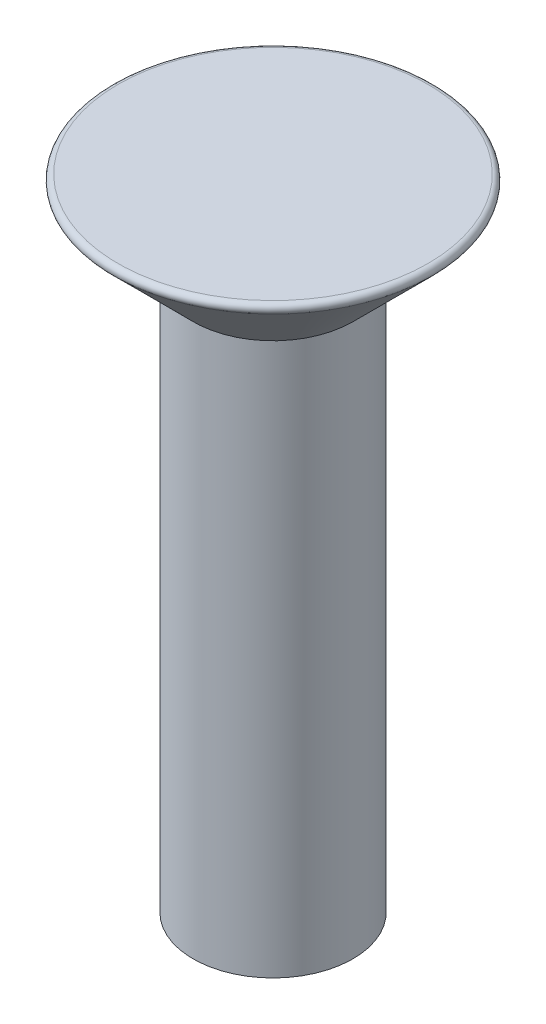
ISO-10303-21;
HEADER;
FILE_DESCRIPTION(('STEP AP214'),'2;1');
FILE_NAME('part.step','',(''),(''),'','','');
FILE_SCHEMA(('AUTOMOTIVE_DESIGN { 1 0 10303 214 1 1 1 1 }'));
ENDSEC;
DATA;
#1=APPLICATION_CONTEXT('core data for automotive mechanical design processes');
#2=APPLICATION_PROTOCOL_DEFINITION('international standard','automotive_design',2000,#1);
#3=PRODUCT_CONTEXT('',#1,'mechanical');
#4=PRODUCT('Part','Part','',(#3));
#5=PRODUCT_RELATED_PRODUCT_CATEGORY('part','',(#4));
#6=PRODUCT_DEFINITION_FORMATION('','',#4);
#7=PRODUCT_DEFINITION_CONTEXT('part definition',#1,'design');
#8=PRODUCT_DEFINITION('design','',#6,#7);
#9=PRODUCT_DEFINITION_SHAPE('','',#8);
#10=(LENGTH_UNIT() NAMED_UNIT(*) SI_UNIT(.MILLI.,.METRE.));
#11=(NAMED_UNIT(*) PLANE_ANGLE_UNIT() SI_UNIT($,.RADIAN.));
#12=(NAMED_UNIT(*) SI_UNIT($,.STERADIAN.) SOLID_ANGLE_UNIT());
#13=UNCERTAINTY_MEASURE_WITH_UNIT(LENGTH_MEASURE(1.E-05),#10,'distance_accuracy_value','');
#14=(GEOMETRIC_REPRESENTATION_CONTEXT(3) GLOBAL_UNCERTAINTY_ASSIGNED_CONTEXT((#13)) GLOBAL_UNIT_ASSIGNED_CONTEXT((#10,
#11,#12)) REPRESENTATION_CONTEXT('',''));
#15=CARTESIAN_POINT('',(0.,0.,0.));
#16=DIRECTION('',(0.,0.,1.));
#17=DIRECTION('',(1.,0.,0.));
#18=AXIS2_PLACEMENT_3D('',#15,#16,#17);
#19=CARTESIAN_POINT('',(0.,0.,0.));
#20=DIRECTION('',(0.,-1.,0.));
#21=DIRECTION('',(0.,0.,-1.));
#22=AXIS2_PLACEMENT_3D('',#19,#20,#21);
#23=PLANE('',#22);
#24=CARTESIAN_POINT('',(0.,0.,0.));
#25=DIRECTION('',(0.,-1.,0.));
#26=DIRECTION('',(-1.,0.,0.));
#27=AXIS2_PLACEMENT_3D('',#24,#25,#26);
#28=CIRCLE('',#27,2.908578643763);
#29=CARTESIAN_POINT('',(-2.908578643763,0.,0.));
#30=VERTEX_POINT('',#29);
#31=CARTESIAN_POINT('',(2.908578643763,0.,0.));
#32=VERTEX_POINT('',#31);
#33=EDGE_CURVE('E37',#30,#32,#28,.T.);
#34=ORIENTED_EDGE('',*,*,#33,.F.);
#35=CARTESIAN_POINT('',(0.,0.,0.));
#36=DIRECTION('',(0.,-1.,0.));
#37=DIRECTION('',(1.,0.,0.));
#38=AXIS2_PLACEMENT_3D('',#35,#36,#37);
#39=CIRCLE('',#38,2.908578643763);
#40=EDGE_CURVE('E33',#32,#30,#39,.T.);
#41=ORIENTED_EDGE('',*,*,#40,.F.);
#42=EDGE_LOOP('',(#34,#41));
#43=FACE_BOUND('',#42,.T.);
#44=ADVANCED_FACE('F16',(#43),#23,.F.);
#45=CARTESIAN_POINT('',(0.,-0.1,0.));
#46=DIRECTION('',(0.,-1.,0.));
#47=DIRECTION('',(-1.,0.,0.));
#48=AXIS2_PLACEMENT_3D('',#45,#46,#47);
#49=TOROIDAL_SURFACE('',#48,2.908578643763,0.1);
#50=CARTESIAN_POINT('',(0.,-0.170710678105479,0.));
#51=DIRECTION('',(0.,1.,0.));
#52=DIRECTION('',(1.,0.,0.));
#53=AXIS2_PLACEMENT_3D('',#50,#51,#52);
#54=CIRCLE('',#53,2.97928932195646);
#55=CARTESIAN_POINT('',(2.97928932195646,-0.170710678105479,0.));
#56=VERTEX_POINT('',#55);
#57=EDGE_CURVE('E43',#56,#56,#54,.F.);
#58=ORIENTED_EDGE('',*,*,#57,.F.);
#59=EDGE_LOOP('',(#58));
#60=FACE_BOUND('',#59,.T.);
#61=ORIENTED_EDGE('',*,*,#33,.T.);
#62=ORIENTED_EDGE('',*,*,#40,.T.);
#63=EDGE_LOOP('',(#61,#62));
#64=FACE_BOUND('',#63,.T.);
#65=ADVANCED_FACE('F42',(#60,#64),#49,.T.);
#66=CARTESIAN_POINT('',(0.,-12.,0.));
#67=DIRECTION('',(0.,-1.,0.));
#68=DIRECTION('',(0.,0.,-1.));
#69=AXIS2_PLACEMENT_3D('',#66,#67,#68);
#70=PLANE('',#69);
#71=CARTESIAN_POINT('',(0.,-12.,0.));
#72=DIRECTION('',(0.,-1.,0.));
#73=DIRECTION('',(0.,0.,-1.));
#74=AXIS2_PLACEMENT_3D('',#71,#72,#73);
#75=CIRCLE('',#74,1.5);
#76=CARTESIAN_POINT('',(0.,-12.,-1.5));
#77=VERTEX_POINT('',#76);
#78=EDGE_CURVE('E27',#77,#77,#75,.F.);
#79=ORIENTED_EDGE('',*,*,#78,.F.);
#80=EDGE_LOOP('',(#79));
#81=FACE_BOUND('',#80,.T.);
#82=ADVANCED_FACE('F60',(#81),#70,.T.);
#83=CARTESIAN_POINT('',(0.,-0.170710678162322,0.));
#84=DIRECTION('',(0.,1.,0.));
#85=DIRECTION('',(0.,0.,1.));
#86=AXIS2_PLACEMENT_3D('',#83,#84,#85);
#87=CONICAL_SURFACE('',#86,2.97928932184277,0.785398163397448);
#88=ORIENTED_EDGE('',*,*,#57,.T.);
#89=EDGE_LOOP('',(#88));
#90=FACE_BOUND('',#89,.T.);
#91=CARTESIAN_POINT('',(0.,-1.65,0.));
#92=DIRECTION('',(0.,-1.,0.));
#93=DIRECTION('',(0.,0.,-1.));
#94=AXIS2_PLACEMENT_3D('',#91,#92,#93);
#95=CIRCLE('',#94,1.5);
#96=CARTESIAN_POINT('',(0.,-1.65,-1.5));
#97=VERTEX_POINT('',#96);
#98=EDGE_CURVE('E11',#97,#97,#95,.T.);
#99=ORIENTED_EDGE('',*,*,#98,.F.);
#100=EDGE_LOOP('',(#99));
#101=FACE_BOUND('',#100,.T.);
#102=ADVANCED_FACE('F73',(#90,#101),#87,.T.);
#103=CARTESIAN_POINT('',(0.,0.6,0.));
#104=DIRECTION('',(0.,-1.,0.));
#105=DIRECTION('',(0.,0.,-1.));
#106=AXIS2_PLACEMENT_3D('',#103,#104,#105);
#107=CYLINDRICAL_SURFACE('',#106,1.5);
#108=ORIENTED_EDGE('',*,*,#98,.T.);
#109=EDGE_LOOP('',(#108));
#110=FACE_BOUND('',#109,.T.);
#111=ORIENTED_EDGE('',*,*,#78,.T.);
#112=EDGE_LOOP('',(#111));
#113=FACE_BOUND('',#112,.T.);
#114=ADVANCED_FACE('F77',(#110,#113),#107,.T.);
#115=CLOSED_SHELL('',(#44,#65,#82,#102,#114));
#116=MANIFOLD_SOLID_BREP('B1',#115);
#117=ADVANCED_BREP_SHAPE_REPRESENTATION('',(#18,#116),#14);
#118=SHAPE_DEFINITION_REPRESENTATION(#9,#117);
ENDSEC;
END-ISO-10303-21;
